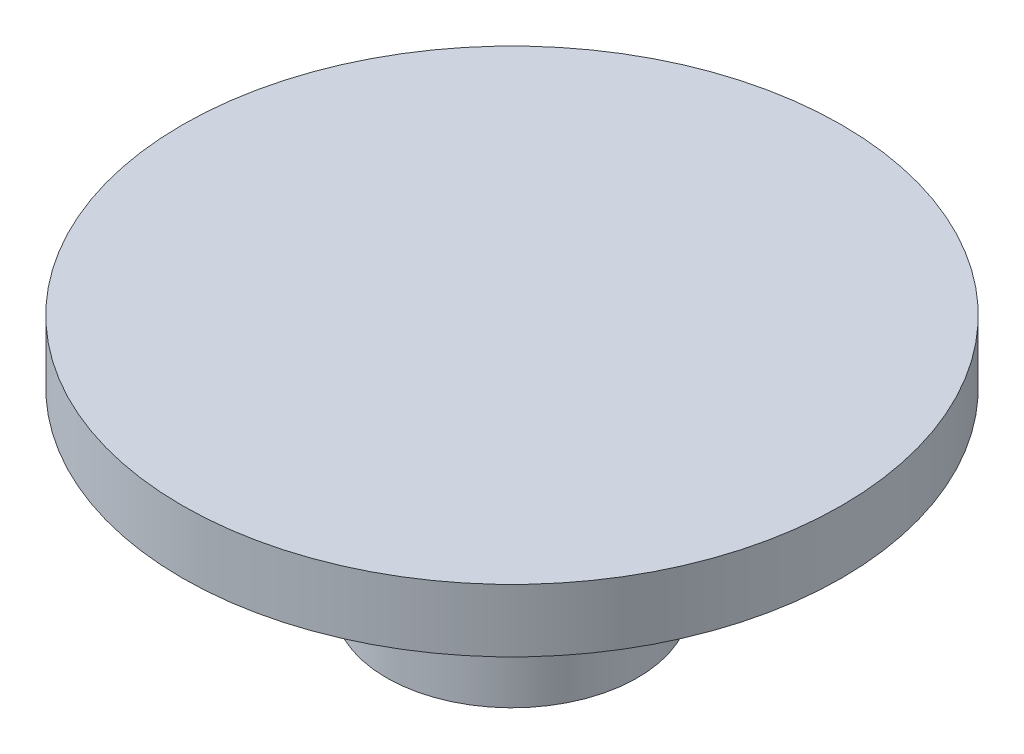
ISO-10303-21;
HEADER;
FILE_DESCRIPTION(('STEP AP214'),'2;1');
FILE_NAME('part.step','',(''),(''),'','','');
FILE_SCHEMA(('AUTOMOTIVE_DESIGN { 1 0 10303 214 1 1 1 1 }'));
ENDSEC;
DATA;
#1=APPLICATION_CONTEXT('core data for automotive mechanical design processes');
#2=APPLICATION_PROTOCOL_DEFINITION('international standard','automotive_design',2000,#1);
#3=PRODUCT_CONTEXT('',#1,'mechanical');
#4=PRODUCT('Part','Part','',(#3));
#5=PRODUCT_RELATED_PRODUCT_CATEGORY('part','',(#4));
#6=PRODUCT_DEFINITION_FORMATION('','',#4);
#7=PRODUCT_DEFINITION_CONTEXT('part definition',#1,'design');
#8=PRODUCT_DEFINITION('design','',#6,#7);
#9=PRODUCT_DEFINITION_SHAPE('','',#8);
#10=(LENGTH_UNIT() NAMED_UNIT(*) SI_UNIT(.MILLI.,.METRE.));
#11=(NAMED_UNIT(*) PLANE_ANGLE_UNIT() SI_UNIT($,.RADIAN.));
#12=(NAMED_UNIT(*) SI_UNIT($,.STERADIAN.) SOLID_ANGLE_UNIT());
#13=UNCERTAINTY_MEASURE_WITH_UNIT(LENGTH_MEASURE(1.E-05),#10,'distance_accuracy_value','');
#14=(GEOMETRIC_REPRESENTATION_CONTEXT(3) GLOBAL_UNCERTAINTY_ASSIGNED_CONTEXT((#13)) GLOBAL_UNIT_ASSIGNED_CONTEXT((#10,
#11,#12)) REPRESENTATION_CONTEXT('',''));
#15=CARTESIAN_POINT('',(0.,0.,0.));
#16=DIRECTION('',(0.,0.,1.));
#17=DIRECTION('',(1.,0.,0.));
#18=AXIS2_PLACEMENT_3D('',#15,#16,#17);
#19=CARTESIAN_POINT('',(0.,6.,0.));
#20=DIRECTION('',(0.,-1.,0.));
#21=DIRECTION('',(0.,0.,-1.));
#22=AXIS2_PLACEMENT_3D('',#19,#20,#21);
#23=CYLINDRICAL_SURFACE('',#22,4.);
#24=CARTESIAN_POINT('',(0.,6.,0.));
#25=DIRECTION('',(0.,1.,0.));
#26=DIRECTION('',(0.,0.,1.));
#27=AXIS2_PLACEMENT_3D('',#24,#25,#26);
#28=CIRCLE('',#27,4.);
#29=CARTESIAN_POINT('',(0.,6.,4.));
#30=VERTEX_POINT('',#29);
#31=EDGE_CURVE('E10',#30,#30,#28,.T.);
#32=ORIENTED_EDGE('',*,*,#31,.F.);
#33=EDGE_LOOP('',(#32));
#34=FACE_BOUND('',#33,.T.);
#35=CARTESIAN_POINT('',(0.,0.,0.));
#36=DIRECTION('',(0.,1.,0.));
#37=DIRECTION('',(0.,0.,1.));
#38=AXIS2_PLACEMENT_3D('',#35,#36,#37);
#39=CIRCLE('',#38,4.);
#40=CARTESIAN_POINT('',(0.,0.,4.));
#41=VERTEX_POINT('',#40);
#42=EDGE_CURVE('E34',#41,#41,#39,.T.);
#43=ORIENTED_EDGE('',*,*,#42,.T.);
#44=EDGE_LOOP('',(#43));
#45=FACE_BOUND('',#44,.T.);
#46=ADVANCED_FACE('F31',(#34,#45),#23,.T.);
#47=CARTESIAN_POINT('',(0.,0.,0.));
#48=DIRECTION('',(0.,1.,0.));
#49=DIRECTION('',(0.,0.,1.));
#50=AXIS2_PLACEMENT_3D('',#47,#48,#49);
#51=PLANE('',#50);
#52=ORIENTED_EDGE('',*,*,#42,.F.);
#53=EDGE_LOOP('',(#52));
#54=FACE_BOUND('',#53,.T.);
#55=ADVANCED_FACE('F59',(#54),#51,.F.);
#56=CARTESIAN_POINT('',(0.,6.,0.));
#57=DIRECTION('',(0.,1.,0.));
#58=DIRECTION('',(0.,0.,1.));
#59=AXIS2_PLACEMENT_3D('',#56,#57,#58);
#60=PLANE('',#59);
#61=CARTESIAN_POINT('',(0.,6.,0.));
#62=DIRECTION('',(0.,1.,0.));
#63=DIRECTION('',(0.,0.,1.));
#64=AXIS2_PLACEMENT_3D('',#61,#62,#63);
#65=CIRCLE('',#64,10.5);
#66=CARTESIAN_POINT('',(0.,6.,10.5));
#67=VERTEX_POINT('',#66);
#68=EDGE_CURVE('E43',#67,#67,#65,.T.);
#69=ORIENTED_EDGE('',*,*,#68,.F.);
#70=EDGE_LOOP('',(#69));
#71=FACE_BOUND('',#70,.T.);
#72=ORIENTED_EDGE('',*,*,#31,.T.);
#73=EDGE_LOOP('',(#72));
#74=FACE_BOUND('',#73,.T.);
#75=ADVANCED_FACE('F54',(#71,#74),#60,.F.);
#76=CARTESIAN_POINT('',(0.,8.,0.));
#77=DIRECTION('',(0.,-1.,0.));
#78=DIRECTION('',(0.,0.,-1.));
#79=AXIS2_PLACEMENT_3D('',#76,#77,#78);
#80=CYLINDRICAL_SURFACE('',#79,10.5);
#81=CARTESIAN_POINT('',(0.,8.,0.));
#82=DIRECTION('',(0.,1.,0.));
#83=DIRECTION('',(0.,0.,1.));
#84=AXIS2_PLACEMENT_3D('',#81,#82,#83);
#85=CIRCLE('',#84,10.5);
#86=CARTESIAN_POINT('',(0.,8.,10.5));
#87=VERTEX_POINT('',#86);
#88=EDGE_CURVE('E41',#87,#87,#85,.T.);
#89=ORIENTED_EDGE('',*,*,#88,.F.);
#90=EDGE_LOOP('',(#89));
#91=FACE_BOUND('',#90,.T.);
#92=ORIENTED_EDGE('',*,*,#68,.T.);
#93=EDGE_LOOP('',(#92));
#94=FACE_BOUND('',#93,.T.);
#95=ADVANCED_FACE('F51',(#91,#94),#80,.T.);
#96=CARTESIAN_POINT('',(0.,8.,0.));
#97=DIRECTION('',(0.,1.,0.));
#98=DIRECTION('',(0.,0.,1.));
#99=AXIS2_PLACEMENT_3D('',#96,#97,#98);
#100=PLANE('',#99);
#101=ORIENTED_EDGE('',*,*,#88,.T.);
#102=EDGE_LOOP('',(#101));
#103=FACE_BOUND('',#102,.T.);
#104=ADVANCED_FACE('F49',(#103),#100,.T.);
#105=CLOSED_SHELL('',(#46,#55,#75,#95,#104));
#106=MANIFOLD_SOLID_BREP('B2',#105);
#107=ADVANCED_BREP_SHAPE_REPRESENTATION('',(#18,#106),#14);
#108=SHAPE_DEFINITION_REPRESENTATION(#9,#107);
ENDSEC;
END-ISO-10303-21;
